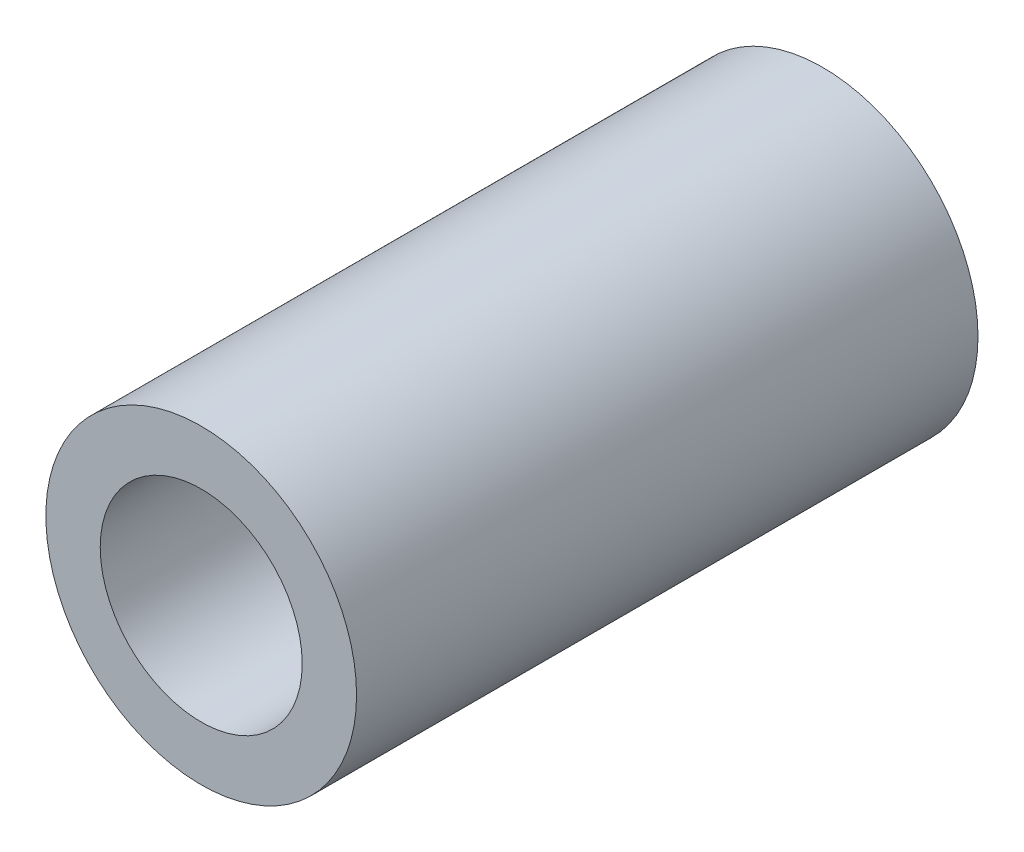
ISO-10303-21;
HEADER;
FILE_DESCRIPTION(('STEP AP214'),'2;1');
FILE_NAME('part.step','',(''),(''),'','','');
FILE_SCHEMA(('AUTOMOTIVE_DESIGN { 1 0 10303 214 1 1 1 1 }'));
ENDSEC;
DATA;
#1=APPLICATION_CONTEXT('core data for automotive mechanical design processes');
#2=APPLICATION_PROTOCOL_DEFINITION('international standard','automotive_design',2000,#1);
#3=PRODUCT_CONTEXT('',#1,'mechanical');
#4=PRODUCT('Part','Part','',(#3));
#5=PRODUCT_RELATED_PRODUCT_CATEGORY('part','',(#4));
#6=PRODUCT_DEFINITION_FORMATION('','',#4);
#7=PRODUCT_DEFINITION_CONTEXT('part definition',#1,'design');
#8=PRODUCT_DEFINITION('design','',#6,#7);
#9=PRODUCT_DEFINITION_SHAPE('','',#8);
#10=(LENGTH_UNIT() NAMED_UNIT(*) SI_UNIT(.MILLI.,.METRE.));
#11=(NAMED_UNIT(*) PLANE_ANGLE_UNIT() SI_UNIT($,.RADIAN.));
#12=(NAMED_UNIT(*) SI_UNIT($,.STERADIAN.) SOLID_ANGLE_UNIT());
#13=UNCERTAINTY_MEASURE_WITH_UNIT(LENGTH_MEASURE(1.E-05),#10,'distance_accuracy_value','');
#14=(GEOMETRIC_REPRESENTATION_CONTEXT(3) GLOBAL_UNCERTAINTY_ASSIGNED_CONTEXT((#13)) GLOBAL_UNIT_ASSIGNED_CONTEXT((#10,
#11,#12)) REPRESENTATION_CONTEXT('',''));
#15=CARTESIAN_POINT('',(0.,0.,0.));
#16=DIRECTION('',(0.,0.,1.));
#17=DIRECTION('',(1.,0.,0.));
#18=AXIS2_PLACEMENT_3D('',#15,#16,#17);
#19=CARTESIAN_POINT('',(0.,0.,20.));
#20=DIRECTION('',(0.,0.,1.));
#21=DIRECTION('',(1.,0.,0.));
#22=AXIS2_PLACEMENT_3D('',#19,#20,#21);
#23=PLANE('',#22);
#24=CARTESIAN_POINT('',(0.,0.,20.));
#25=DIRECTION('',(0.,0.,1.));
#26=DIRECTION('',(1.,0.,0.));
#27=AXIS2_PLACEMENT_3D('',#24,#25,#26);
#28=CIRCLE('',#27,5.);
#29=CARTESIAN_POINT('',(5.,0.,20.));
#30=VERTEX_POINT('',#29);
#31=EDGE_CURVE('E10',#30,#30,#28,.T.);
#32=ORIENTED_EDGE('',*,*,#31,.T.);
#33=EDGE_LOOP('',(#32));
#34=FACE_BOUND('',#33,.T.);
#35=CARTESIAN_POINT('',(0.,0.,20.));
#36=DIRECTION('',(0.,0.,1.));
#37=DIRECTION('',(1.,0.,0.));
#38=AXIS2_PLACEMENT_3D('',#35,#36,#37);
#39=CIRCLE('',#38,3.25);
#40=CARTESIAN_POINT('',(3.25,0.,20.));
#41=VERTEX_POINT('',#40);
#42=EDGE_CURVE('E40',#41,#41,#39,.T.);
#43=ORIENTED_EDGE('',*,*,#42,.F.);
#44=EDGE_LOOP('',(#43));
#45=FACE_BOUND('',#44,.T.);
#46=ADVANCED_FACE('F29',(#34,#45),#23,.T.);
#47=CARTESIAN_POINT('',(0.,0.,0.));
#48=DIRECTION('',(0.,0.,1.));
#49=DIRECTION('',(1.,0.,0.));
#50=AXIS2_PLACEMENT_3D('',#47,#48,#49);
#51=PLANE('',#50);
#52=CARTESIAN_POINT('',(0.,0.,0.));
#53=DIRECTION('',(0.,0.,1.));
#54=DIRECTION('',(1.,0.,0.));
#55=AXIS2_PLACEMENT_3D('',#52,#53,#54);
#56=CIRCLE('',#55,5.);
#57=CARTESIAN_POINT('',(5.,0.,0.));
#58=VERTEX_POINT('',#57);
#59=EDGE_CURVE('E33',#58,#58,#56,.T.);
#60=ORIENTED_EDGE('',*,*,#59,.F.);
#61=EDGE_LOOP('',(#60));
#62=FACE_BOUND('',#61,.T.);
#63=CARTESIAN_POINT('',(0.,0.,0.));
#64=DIRECTION('',(0.,0.,1.));
#65=DIRECTION('',(1.,0.,0.));
#66=AXIS2_PLACEMENT_3D('',#63,#64,#65);
#67=CIRCLE('',#66,3.25);
#68=CARTESIAN_POINT('',(3.25,0.,0.));
#69=VERTEX_POINT('',#68);
#70=EDGE_CURVE('E42',#69,#69,#67,.T.);
#71=ORIENTED_EDGE('',*,*,#70,.T.);
#72=EDGE_LOOP('',(#71));
#73=FACE_BOUND('',#72,.T.);
#74=ADVANCED_FACE('F52',(#62,#73),#51,.F.);
#75=CARTESIAN_POINT('',(0.,0.,20.));
#76=DIRECTION('',(0.,0.,-1.));
#77=DIRECTION('',(-1.,0.,0.));
#78=AXIS2_PLACEMENT_3D('',#75,#76,#77);
#79=CYLINDRICAL_SURFACE('',#78,5.);
#80=ORIENTED_EDGE('',*,*,#31,.F.);
#81=EDGE_LOOP('',(#80));
#82=FACE_BOUND('',#81,.T.);
#83=ORIENTED_EDGE('',*,*,#59,.T.);
#84=EDGE_LOOP('',(#83));
#85=FACE_BOUND('',#84,.T.);
#86=ADVANCED_FACE('F31',(#82,#85),#79,.T.);
#87=CARTESIAN_POINT('',(0.,0.,20.));
#88=DIRECTION('',(0.,0.,-1.));
#89=DIRECTION('',(-1.,0.,0.));
#90=AXIS2_PLACEMENT_3D('',#87,#88,#89);
#91=CYLINDRICAL_SURFACE('',#90,3.25);
#92=ORIENTED_EDGE('',*,*,#42,.T.);
#93=EDGE_LOOP('',(#92));
#94=FACE_BOUND('',#93,.T.);
#95=ORIENTED_EDGE('',*,*,#70,.F.);
#96=EDGE_LOOP('',(#95));
#97=FACE_BOUND('',#96,.T.);
#98=ADVANCED_FACE('F48',(#94,#97),#91,.F.);
#99=CLOSED_SHELL('',(#46,#74,#86,#98));
#100=MANIFOLD_SOLID_BREP('B2',#99);
#101=ADVANCED_BREP_SHAPE_REPRESENTATION('',(#18,#100),#14);
#102=SHAPE_DEFINITION_REPRESENTATION(#9,#101);
ENDSEC;
END-ISO-10303-21;
